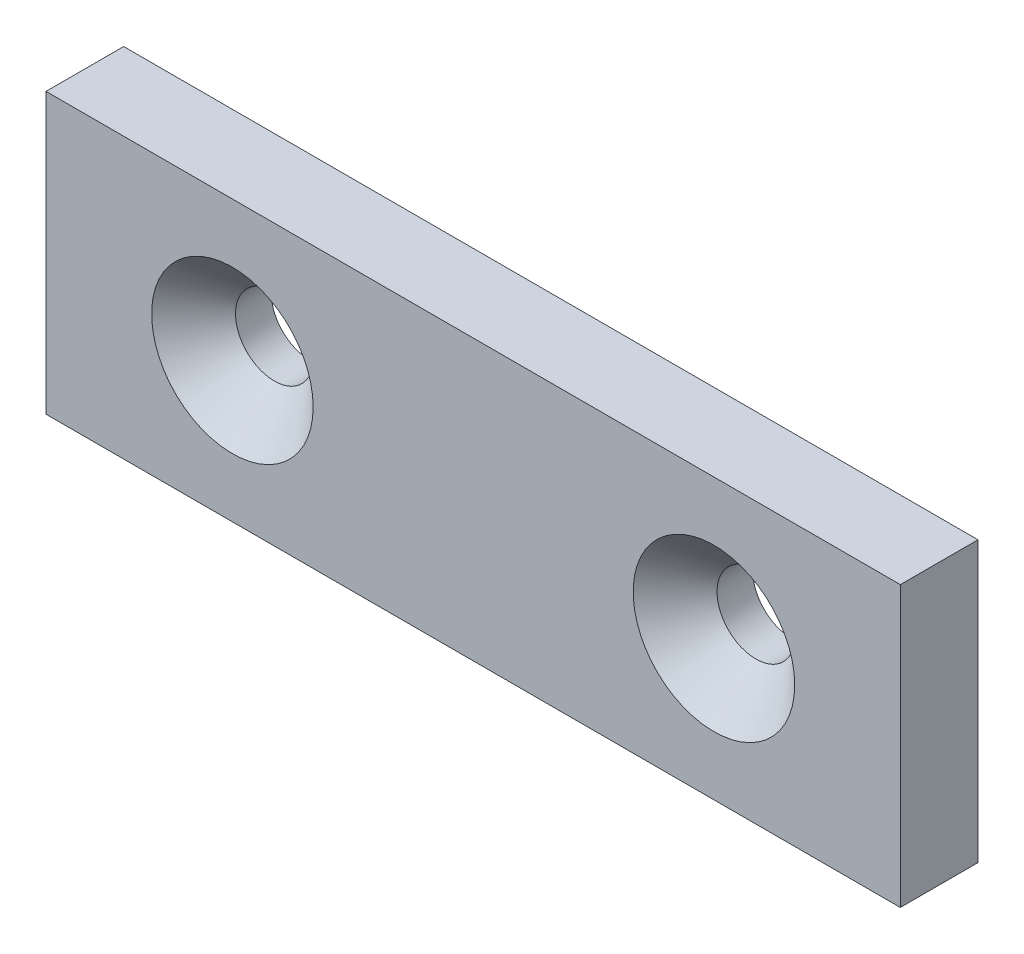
from build123d import *

# Parameters (mm, degrees)
SKETCH2_W                                      = 55
SKETCH2_H                                      = 18
BOSS_EXTRUDE1_DEPTH                            = 5
CSK_FOR_M5_FLAT_HEAD_MACHINE_SCREW1_AT_2_COUNT = 2
CSK_FOR_M5_FLAT_HEAD_MACHINE_SCREW1_AT_2_PITCH = 31


with BuildPart() as part:
    # Sketch2 → Boss-Extrude1 (new body)
    with BuildSketch(Plane.XY):
        with Locations((27.5, 9)):
            Rectangle(SKETCH2_W, SKETCH2_H)
    extrude(amount=BOSS_EXTRUDE1_DEPTH)

    # Sketch4 → CSK for M5 Flat Head Machine Screw1 (revolve, cut)
    with BuildSketch(Plane(origin=(12, 9, 5), x_dir=(0, -1, 0), z_dir=(1, 0, 0))):
        Polygon((0, 0), (0, 5), (2.5, 5), (2.5, 2.7), (5.2, 0), align=None)
    csk_for_m5_flat_head_machine_screw1 = revolve(axis=Axis((12, 9, 11.35), (0, 0, -1)), mode=Mode.SUBTRACT)

    # CSK for M5 Flat Head Machine Screw1 at 2: CSK for M5 Flat Head Machine Screw1 ×2
    with Locations(*[(i * CSK_FOR_M5_FLAT_HEAD_MACHINE_SCREW1_AT_2_PITCH, 0, 0) for i in range(1, CSK_FOR_M5_FLAT_HEAD_MACHINE_SCREW1_AT_2_COUNT)]):
        add(csk_for_m5_flat_head_machine_screw1, mode=Mode.SUBTRACT)


solid = part.part
